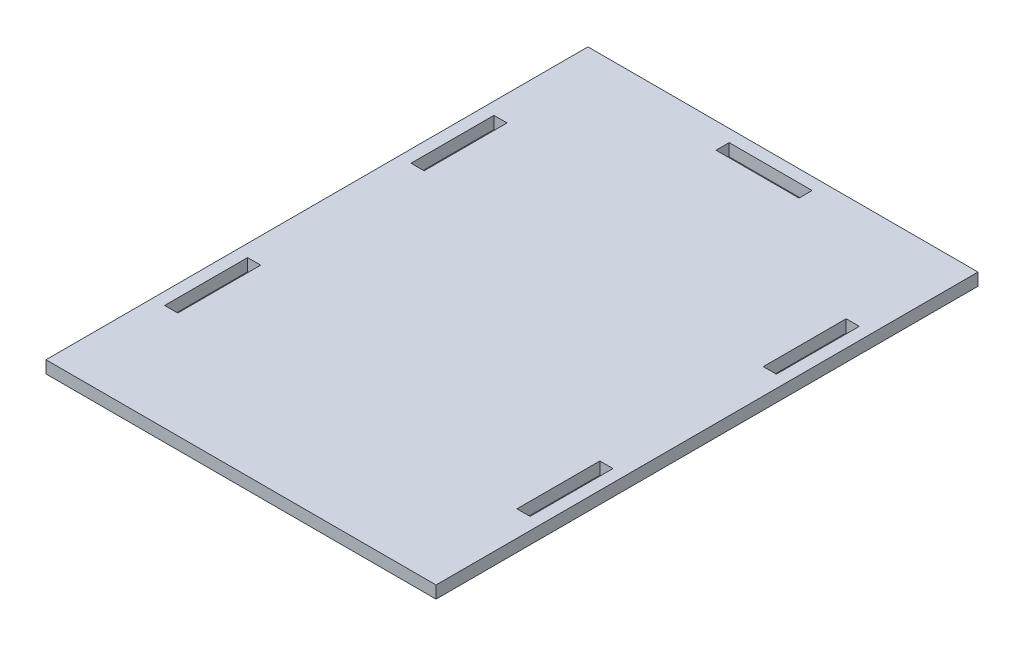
from build123d import *

# Parameters (mm, degrees)
CROQUIS1_W              = 445
CROQUIS1_H              = 630
SALIENTE_EXTRUIR1_DEPTH = 15
CROQUIS2_W              = 475
CROQUIS2_H              = 660
CROQUIS2_W_2            = 445
CROQUIS2_H_2            = 630
SALIENTE_EXTRUIR2_DEPTH = 15
CROQUIS3_W              = 16
CROQUIS3_H              = 101
CROQUIS3_W_2            = 101
CROQUIS3_H_2            = 16
CORTAR_EXTRUIR1_DEPTH   = 407.855318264


with BuildPart() as part:
    # Croquis1 → Saliente-Extruir1 (new body)
    with BuildSketch(Plane(origin=(0, 0, 0), x_dir=(1, 0, 0), z_dir=(0, 1, 0))):
        Rectangle(CROQUIS1_W, CROQUIS1_H)
    extrude(amount=SALIENTE_EXTRUIR1_DEPTH)

    # Croquis2 → Saliente-Extruir2 (add)
    with BuildSketch(Plane(origin=(0, 15, 0), x_dir=(1, 0, 0), z_dir=(0, 1, 0))):
        Rectangle(CROQUIS2_W, CROQUIS2_H)
        Rectangle(CROQUIS2_W_2, CROQUIS2_H_2, mode=Mode.SUBTRACT)
    extrude(amount=-SALIENTE_EXTRUIR2_DEPTH)

    # Croquis3 → Cortar-Extruir1 (cut, through all)
    with BuildSketch(Plane(origin=(0, 15, 0), x_dir=(1, 0, 0), z_dir=(0, 1, 0))):
        with Locations((-214.5, 150)):
            Rectangle(CROQUIS3_W, CROQUIS3_H)
        with Locations((-214.5, -150)):
            Rectangle(CROQUIS3_W, CROQUIS3_H)
        with Locations((0, 307)):
            Rectangle(CROQUIS3_W_2, CROQUIS3_H_2)
        with Locations((214.5, -150)):
            Rectangle(CROQUIS3_W, CROQUIS3_H)
        with Locations((214.5, 150)):
            Rectangle(CROQUIS3_W, CROQUIS3_H)
    extrude(amount=-CORTAR_EXTRUIR1_DEPTH, mode=Mode.SUBTRACT)


solid = part.part
